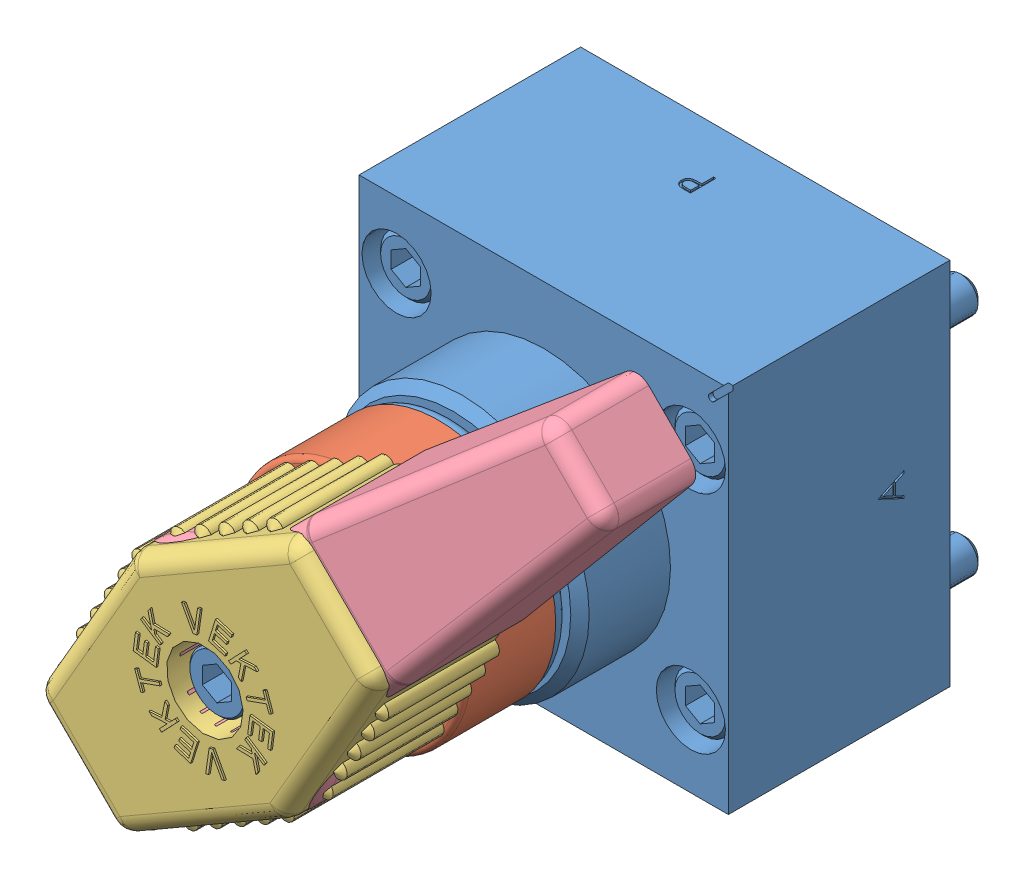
SolidWorks assembly ILC71147202.SLDASM, configuration Default (file format 5000). Lengths in mm.
Overall size (58.16 58.16 85.03).
4 component instances, 4 part files, 9 mates.
Components (placement in the parent):
- ILC71147202_BASE-1: ILC71147202_BASE.sldprt [Default] at (24.5753 -43.9487 -20.9992) size (50.8 50.8 82.8)
- ILC71147202_ADAPTER-1: ILC71147202_ADAPTER.sldprt [Default] at (-0.8247 -18.5487 45.1678) x (0 0 -1) z (1 0 0) size (22.23 32.26 32.26)
- 85600903-1: 85600903.sldprt [Default] at (-0.8247 -18.5487 56.0898) x (0.707107 0.707107 0) z (0.707107 -0.707107 0) size (51.61 19.62 30.64)
- 85600902-1: 85600902.SLDPRT [Default] at (-0.8247 -18.5487 37.0398) x (0 0 1) z (0.707107 -0.707107 0) size (17.76 89.76 30.23) (hidden)
Mates (geometry in assembly coordinates):
- Concentric1: concentric anti-aligned: cylinder of ILC71147202_BASE-1 through (-0.8247 -18.5487 39.3703) axis (0 0 1) radius 3.9624; circle of ILC71147202_ADAPTER-1
- Coincident2: coincident anti-aligned: plane of ILC71147202_BASE-1 through (-0.8247 -18.5487 22.9428) normal (0 0 1); plane of ILC71147202_ADAPTER-1 through (-0.8247 -18.5487 22.9428) normal (0 0 -1)
- Parallel2: parallel aligned: plane of ILC71147202_BASE-1 through (22.6068 4.2478 9.4808) normal (-0.707107 0.707107 0); plane of ILC71147202_ADAPTER-1 through (-11.8229 -13.9931 45.1678) normal (-0.707107 0.707107 0)
- Concentric2: concentric aligned: cylinder of ILC71147202_BASE-1 through (-0.8247 -18.5487 39.3703) axis (0 0 1) radius 3.9624; cylinder of 85600903-1 through (-0.8247 -18.5487 27.7933) axis (0 0 1) radius 5.2705
- Parallel3: parallel anti-aligned: plane of ILC71147202_ADAPTER-1 through (-11.8229 -13.9931 45.1678) normal (-0.707107 0.707107 0); plane of 85600903-1 through (-12.0007 -13.9194 37.0398) normal (0.707107 -0.707107 0)
- Coincident5: coincident anti-aligned: plane of ILC71147202_ADAPTER-1 through (-0.8247 -18.5487 45.1678) normal (0 0 1); plane of 85600903-1 through (-0.8247 -18.5487 45.1678) normal (0 0 -1)
- Concentric3: concentric aligned: cylinder of ILC71147202_BASE-1 through (-0.8247 -18.5487 39.3703) axis (0 0 1) radius 2.413; cylinder of 85600902-1 through (-0.8247 -18.5487 40.9768) axis (0 0 1) radius 2.6035
- Parallel4: parallel anti-aligned: plane of ILC71147202_ADAPTER-1 through (-11.8229 -13.9931 45.1678) normal (-0.707107 0.707107 0); plane of 85600902-1 through (-12.0007 -13.9194 37.0398) normal (0.707107 -0.707107 0)
- Coincident8: coincident anti-aligned: plane of ILC71147202_ADAPTER-1 through (-0.8247 -18.5487 45.1678) normal (0 0 1); plane of 85600902-1 through (-0.8247 -18.5487 45.1678) normal (0 0 -1)
